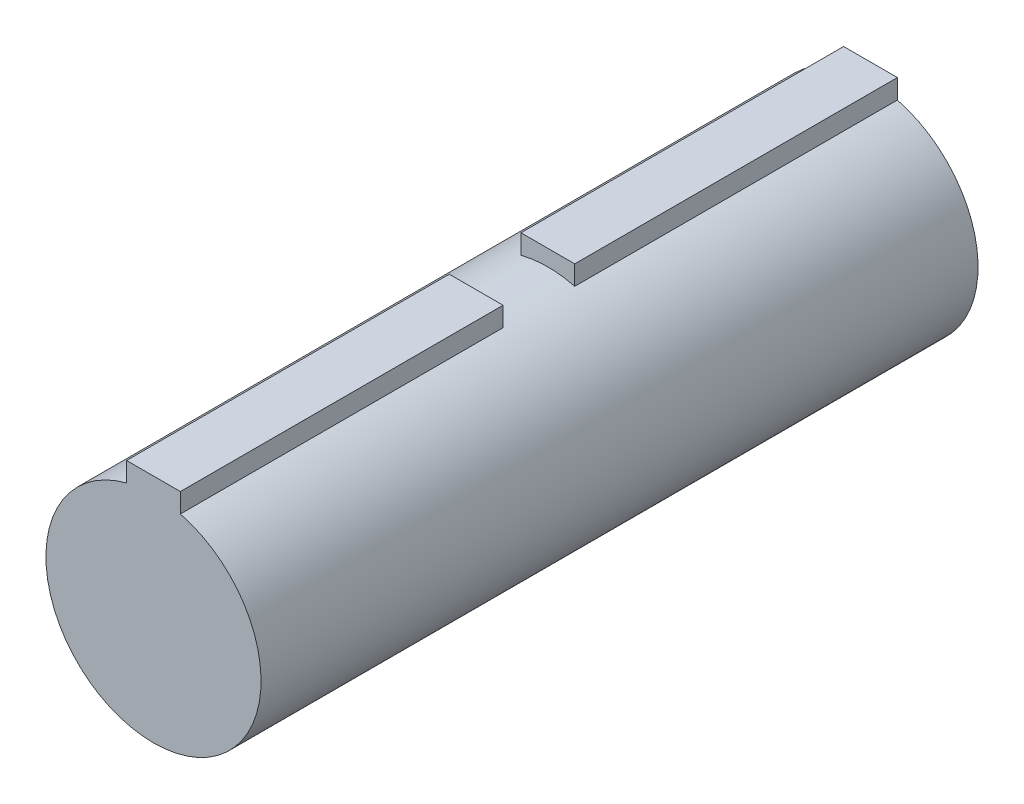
ISO-10303-21;
HEADER;
FILE_DESCRIPTION(('STEP AP214'),'2;1');
FILE_NAME('part.step','',(''),(''),'','','');
FILE_SCHEMA(('AUTOMOTIVE_DESIGN { 1 0 10303 214 1 1 1 1 }'));
ENDSEC;
DATA;
#1=APPLICATION_CONTEXT('core data for automotive mechanical design processes');
#2=APPLICATION_PROTOCOL_DEFINITION('international standard','automotive_design',2000,#1);
#3=PRODUCT_CONTEXT('',#1,'mechanical');
#4=PRODUCT('Part','Part','',(#3));
#5=PRODUCT_RELATED_PRODUCT_CATEGORY('part','',(#4));
#6=PRODUCT_DEFINITION_FORMATION('','',#4);
#7=PRODUCT_DEFINITION_CONTEXT('part definition',#1,'design');
#8=PRODUCT_DEFINITION('design','',#6,#7);
#9=PRODUCT_DEFINITION_SHAPE('','',#8);
#10=(LENGTH_UNIT() NAMED_UNIT(*) SI_UNIT(.MILLI.,.METRE.));
#11=(NAMED_UNIT(*) PLANE_ANGLE_UNIT() SI_UNIT($,.RADIAN.));
#12=(NAMED_UNIT(*) SI_UNIT($,.STERADIAN.) SOLID_ANGLE_UNIT());
#13=UNCERTAINTY_MEASURE_WITH_UNIT(LENGTH_MEASURE(1.E-05),#10,'distance_accuracy_value','');
#14=(GEOMETRIC_REPRESENTATION_CONTEXT(3) GLOBAL_UNCERTAINTY_ASSIGNED_CONTEXT((#13)) GLOBAL_UNIT_ASSIGNED_CONTEXT((#10,
#11,#12)) REPRESENTATION_CONTEXT('',''));
#15=CARTESIAN_POINT('',(0.,0.,0.));
#16=DIRECTION('',(0.,0.,1.));
#17=DIRECTION('',(1.,0.,0.));
#18=AXIS2_PLACEMENT_3D('',#15,#16,#17);
#19=CARTESIAN_POINT('',(-2.38125,10.9473999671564,28.575));
#20=DIRECTION('',(1.,0.,0.));
#21=DIRECTION('',(0.,1.,0.));
#22=AXIS2_PLACEMENT_3D('',#19,#20,#21);
#23=PLANE('',#22);
#24=DIRECTION('',(0.,-1.,0.));
#25=VECTOR('',#24,1.);
#26=CARTESIAN_POINT('',(-2.38125,10.9473999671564,0.));
#27=LINE('',#26,#25);
#28=CARTESIAN_POINT('',(-2.38125,10.9473999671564,0.));
#29=VERTEX_POINT('',#28);
#30=CARTESIAN_POINT('',(-2.38125,9.22254159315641,0.));
#31=VERTEX_POINT('',#30);
#32=EDGE_CURVE('E153',#29,#31,#27,.T.);
#33=ORIENTED_EDGE('',*,*,#32,.T.);
#34=DIRECTION('',(0.,0.,-1.));
#35=VECTOR('',#34,1.);
#36=CARTESIAN_POINT('',(-2.38125,9.22254159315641,28.575));
#37=LINE('',#36,#35);
#38=CARTESIAN_POINT('',(-2.38125,9.22254159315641,28.575));
#39=VERTEX_POINT('',#38);
#40=EDGE_CURVE('E11',#39,#31,#37,.T.);
#41=ORIENTED_EDGE('',*,*,#40,.F.);
#42=DIRECTION('',(0.,-1.,0.));
#43=VECTOR('',#42,1.);
#44=CARTESIAN_POINT('',(-2.38125,10.9473999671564,28.575));
#45=LINE('',#44,#43);
#46=CARTESIAN_POINT('',(-2.38125,10.9473999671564,28.575));
#47=VERTEX_POINT('',#46);
#48=EDGE_CURVE('E89',#47,#39,#45,.T.);
#49=ORIENTED_EDGE('',*,*,#48,.F.);
#50=DIRECTION('',(0.,0.,-1.));
#51=VECTOR('',#50,1.);
#52=CARTESIAN_POINT('',(-2.38125,10.9473999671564,28.575));
#53=LINE('',#52,#51);
#54=EDGE_CURVE('E65',#47,#29,#53,.T.);
#55=ORIENTED_EDGE('',*,*,#54,.T.);
#56=EDGE_LOOP('',(#33,#41,#49,#55));
#57=FACE_BOUND('',#56,.T.);
#58=ADVANCED_FACE('F41',(#57),#23,.F.);
#59=CARTESIAN_POINT('',(0.,0.,28.575));
#60=DIRECTION('',(0.,0.,-1.));
#61=DIRECTION('',(-1.,0.,0.));
#62=AXIS2_PLACEMENT_3D('',#59,#60,#61);
#63=CYLINDRICAL_SURFACE('',#62,9.525);
#64=CARTESIAN_POINT('',(0.,0.,0.));
#65=DIRECTION('',(0.,0.,1.));
#66=DIRECTION('',(1.,0.,0.));
#67=AXIS2_PLACEMENT_3D('',#64,#65,#66);
#68=CIRCLE('',#67,9.525);
#69=CARTESIAN_POINT('',(2.38125,9.22254159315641,0.));
#70=VERTEX_POINT('',#69);
#71=EDGE_CURVE('E166',#31,#70,#68,.T.);
#72=ORIENTED_EDGE('',*,*,#71,.T.);
#73=DIRECTION('',(0.,0.,-1.));
#74=VECTOR('',#73,1.);
#75=CARTESIAN_POINT('',(2.38125,9.22254159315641,28.575));
#76=LINE('',#75,#74);
#77=CARTESIAN_POINT('',(2.38125,9.22254159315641,28.575));
#78=VERTEX_POINT('',#77);
#79=EDGE_CURVE('E49',#78,#70,#76,.T.);
#80=ORIENTED_EDGE('',*,*,#79,.F.);
#81=CARTESIAN_POINT('',(0.,0.,28.575));
#82=DIRECTION('',(0.,0.,1.));
#83=DIRECTION('',(1.,0.,0.));
#84=AXIS2_PLACEMENT_3D('',#81,#82,#83);
#85=CIRCLE('',#84,9.525);
#86=EDGE_CURVE('E142',#78,#39,#85,.T.);
#87=ORIENTED_EDGE('',*,*,#86,.T.);
#88=ORIENTED_EDGE('',*,*,#40,.T.);
#89=EDGE_LOOP('',(#72,#80,#87,#88));
#90=FACE_BOUND('',#89,.T.);
#91=CARTESIAN_POINT('',(0.,0.,34.925));
#92=DIRECTION('',(0.,0.,1.));
#93=DIRECTION('',(1.,0.,0.));
#94=AXIS2_PLACEMENT_3D('',#91,#92,#93);
#95=CIRCLE('',#94,9.525);
#96=CARTESIAN_POINT('',(2.38125,9.22254159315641,34.925));
#97=VERTEX_POINT('',#96);
#98=CARTESIAN_POINT('',(-2.38125,9.22254159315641,34.925));
#99=VERTEX_POINT('',#98);
#100=EDGE_CURVE('E56',#97,#99,#95,.T.);
#101=ORIENTED_EDGE('',*,*,#100,.F.);
#102=DIRECTION('',(0.,0.,-1.));
#103=VECTOR('',#102,1.);
#104=CARTESIAN_POINT('',(2.38125,9.22254159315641,63.5));
#105=LINE('',#104,#103);
#106=CARTESIAN_POINT('',(2.38125,9.22254159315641,63.5));
#107=VERTEX_POINT('',#106);
#108=EDGE_CURVE('E122',#107,#97,#105,.T.);
#109=ORIENTED_EDGE('',*,*,#108,.F.);
#110=CARTESIAN_POINT('',(0.,0.,63.5));
#111=DIRECTION('',(0.,0.,1.));
#112=DIRECTION('',(1.,0.,0.));
#113=AXIS2_PLACEMENT_3D('',#110,#111,#112);
#114=CIRCLE('',#113,9.525);
#115=CARTESIAN_POINT('',(-2.38125,9.22254159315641,63.5));
#116=VERTEX_POINT('',#115);
#117=EDGE_CURVE('E115',#116,#107,#114,.T.);
#118=ORIENTED_EDGE('',*,*,#117,.F.);
#119=DIRECTION('',(0.,0.,-1.));
#120=VECTOR('',#119,1.);
#121=CARTESIAN_POINT('',(-2.38125,9.22254159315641,63.5));
#122=LINE('',#121,#120);
#123=EDGE_CURVE('E119',#116,#99,#122,.T.);
#124=ORIENTED_EDGE('',*,*,#123,.T.);
#125=EDGE_LOOP('',(#101,#109,#118,#124));
#126=FACE_BOUND('',#125,.T.);
#127=ADVANCED_FACE('F117',(#90,#126),#63,.T.);
#128=CARTESIAN_POINT('',(2.38125,10.9473999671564,28.575));
#129=DIRECTION('',(1.,0.,0.));
#130=DIRECTION('',(0.,1.,0.));
#131=AXIS2_PLACEMENT_3D('',#128,#129,#130);
#132=PLANE('',#131);
#133=DIRECTION('',(0.,-1.,0.));
#134=VECTOR('',#133,1.);
#135=CARTESIAN_POINT('',(2.38125,10.9473999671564,0.));
#136=LINE('',#135,#134);
#137=CARTESIAN_POINT('',(2.38125,10.9473999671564,0.));
#138=VERTEX_POINT('',#137);
#139=EDGE_CURVE('E170',#138,#70,#136,.T.);
#140=ORIENTED_EDGE('',*,*,#139,.F.);
#141=DIRECTION('',(0.,0.,-1.));
#142=VECTOR('',#141,1.);
#143=CARTESIAN_POINT('',(2.38125,10.9473999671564,28.575));
#144=LINE('',#143,#142);
#145=CARTESIAN_POINT('',(2.38125,10.9473999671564,28.575));
#146=VERTEX_POINT('',#145);
#147=EDGE_CURVE('E179',#146,#138,#144,.T.);
#148=ORIENTED_EDGE('',*,*,#147,.F.);
#149=DIRECTION('',(0.,-1.,0.));
#150=VECTOR('',#149,1.);
#151=CARTESIAN_POINT('',(2.38125,10.9473999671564,28.575));
#152=LINE('',#151,#150);
#153=EDGE_CURVE('E157',#146,#78,#152,.T.);
#154=ORIENTED_EDGE('',*,*,#153,.T.);
#155=ORIENTED_EDGE('',*,*,#79,.T.);
#156=EDGE_LOOP('',(#140,#148,#154,#155));
#157=FACE_BOUND('',#156,.T.);
#158=ADVANCED_FACE('F185',(#157),#132,.T.);
#159=CARTESIAN_POINT('',(-2.38125,10.9473999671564,28.575));
#160=DIRECTION('',(0.,1.,0.));
#161=DIRECTION('',(0.,0.,1.));
#162=AXIS2_PLACEMENT_3D('',#159,#160,#161);
#163=PLANE('',#162);
#164=DIRECTION('',(1.,0.,0.));
#165=VECTOR('',#164,1.);
#166=CARTESIAN_POINT('',(-2.38125,10.9473999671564,0.));
#167=LINE('',#166,#165);
#168=EDGE_CURVE('E158',#29,#138,#167,.T.);
#169=ORIENTED_EDGE('',*,*,#168,.F.);
#170=ORIENTED_EDGE('',*,*,#54,.F.);
#171=DIRECTION('',(1.,0.,0.));
#172=VECTOR('',#171,1.);
#173=CARTESIAN_POINT('',(-2.38125,10.9473999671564,28.575));
#174=LINE('',#173,#172);
#175=EDGE_CURVE('E161',#47,#146,#174,.T.);
#176=ORIENTED_EDGE('',*,*,#175,.T.);
#177=ORIENTED_EDGE('',*,*,#147,.T.);
#178=EDGE_LOOP('',(#169,#170,#176,#177));
#179=FACE_BOUND('',#178,.T.);
#180=ADVANCED_FACE('F190',(#179),#163,.T.);
#181=CARTESIAN_POINT('',(0.,0.,28.575));
#182=DIRECTION('',(0.,0.,1.));
#183=DIRECTION('',(1.,0.,0.));
#184=AXIS2_PLACEMENT_3D('',#181,#182,#183);
#185=PLANE('',#184);
#186=ORIENTED_EDGE('',*,*,#86,.F.);
#187=ORIENTED_EDGE('',*,*,#153,.F.);
#188=ORIENTED_EDGE('',*,*,#175,.F.);
#189=ORIENTED_EDGE('',*,*,#48,.T.);
#190=EDGE_LOOP('',(#186,#187,#188,#189));
#191=FACE_BOUND('',#190,.T.);
#192=ADVANCED_FACE('F191',(#191),#185,.T.);
#193=CARTESIAN_POINT('',(0.,0.,0.));
#194=DIRECTION('',(0.,0.,1.));
#195=DIRECTION('',(1.,0.,0.));
#196=AXIS2_PLACEMENT_3D('',#193,#194,#195);
#197=PLANE('',#196);
#198=ORIENTED_EDGE('',*,*,#32,.F.);
#199=ORIENTED_EDGE('',*,*,#168,.T.);
#200=ORIENTED_EDGE('',*,*,#139,.T.);
#201=ORIENTED_EDGE('',*,*,#71,.F.);
#202=EDGE_LOOP('',(#198,#199,#200,#201));
#203=FACE_BOUND('',#202,.T.);
#204=ADVANCED_FACE('F189',(#203),#197,.F.);
#205=CARTESIAN_POINT('',(0.,0.,34.925));
#206=DIRECTION('',(0.,0.,1.));
#207=DIRECTION('',(1.,0.,0.));
#208=AXIS2_PLACEMENT_3D('',#205,#206,#207);
#209=PLANE('',#208);
#210=DIRECTION('',(0.,-1.,0.));
#211=VECTOR('',#210,1.);
#212=CARTESIAN_POINT('',(2.38125,10.9473999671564,34.925));
#213=LINE('',#212,#211);
#214=CARTESIAN_POINT('',(2.38125,10.9473999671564,34.925));
#215=VERTEX_POINT('',#214);
#216=EDGE_CURVE('E288',#215,#97,#213,.T.);
#217=ORIENTED_EDGE('',*,*,#216,.T.);
#218=ORIENTED_EDGE('',*,*,#100,.T.);
#219=DIRECTION('',(0.,-1.,0.));
#220=VECTOR('',#219,1.);
#221=CARTESIAN_POINT('',(-2.38125,10.9473999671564,34.925));
#222=LINE('',#221,#220);
#223=CARTESIAN_POINT('',(-2.38125,10.9473999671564,34.925));
#224=VERTEX_POINT('',#223);
#225=EDGE_CURVE('E140',#224,#99,#222,.T.);
#226=ORIENTED_EDGE('',*,*,#225,.F.);
#227=DIRECTION('',(1.,0.,0.));
#228=VECTOR('',#227,1.);
#229=CARTESIAN_POINT('',(-2.38125,10.9473999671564,34.925));
#230=LINE('',#229,#228);
#231=EDGE_CURVE('E137',#224,#215,#230,.T.);
#232=ORIENTED_EDGE('',*,*,#231,.T.);
#233=EDGE_LOOP('',(#217,#218,#226,#232));
#234=FACE_BOUND('',#233,.T.);
#235=ADVANCED_FACE('F198',(#234),#209,.F.);
#236=CARTESIAN_POINT('',(-2.38125,10.9473999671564,63.5));
#237=DIRECTION('',(1.,0.,0.));
#238=DIRECTION('',(0.,0.,-1.));
#239=AXIS2_PLACEMENT_3D('',#236,#237,#238);
#240=PLANE('',#239);
#241=ORIENTED_EDGE('',*,*,#225,.T.);
#242=ORIENTED_EDGE('',*,*,#123,.F.);
#243=DIRECTION('',(0.,-1.,0.));
#244=VECTOR('',#243,1.);
#245=CARTESIAN_POINT('',(-2.38125,10.9473999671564,63.5));
#246=LINE('',#245,#244);
#247=CARTESIAN_POINT('',(-2.38125,10.9473999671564,63.5));
#248=VERTEX_POINT('',#247);
#249=EDGE_CURVE('E128',#248,#116,#246,.T.);
#250=ORIENTED_EDGE('',*,*,#249,.F.);
#251=DIRECTION('',(0.,0.,-1.));
#252=VECTOR('',#251,1.);
#253=CARTESIAN_POINT('',(-2.38125,10.9473999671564,63.5));
#254=LINE('',#253,#252);
#255=EDGE_CURVE('E285',#248,#224,#254,.T.);
#256=ORIENTED_EDGE('',*,*,#255,.T.);
#257=EDGE_LOOP('',(#241,#242,#250,#256));
#258=FACE_BOUND('',#257,.T.);
#259=ADVANCED_FACE('F139',(#258),#240,.F.);
#260=CARTESIAN_POINT('',(2.38125,10.9473999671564,63.5));
#261=DIRECTION('',(1.,0.,0.));
#262=DIRECTION('',(0.,0.,-1.));
#263=AXIS2_PLACEMENT_3D('',#260,#261,#262);
#264=PLANE('',#263);
#265=ORIENTED_EDGE('',*,*,#216,.F.);
#266=DIRECTION('',(0.,0.,-1.));
#267=VECTOR('',#266,1.);
#268=CARTESIAN_POINT('',(2.38125,10.9473999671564,63.5));
#269=LINE('',#268,#267);
#270=CARTESIAN_POINT('',(2.38125,10.9473999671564,63.5));
#271=VERTEX_POINT('',#270);
#272=EDGE_CURVE('E148',#271,#215,#269,.T.);
#273=ORIENTED_EDGE('',*,*,#272,.F.);
#274=DIRECTION('',(0.,-1.,0.));
#275=VECTOR('',#274,1.);
#276=CARTESIAN_POINT('',(2.38125,10.9473999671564,63.5));
#277=LINE('',#276,#275);
#278=EDGE_CURVE('E127',#271,#107,#277,.T.);
#279=ORIENTED_EDGE('',*,*,#278,.T.);
#280=ORIENTED_EDGE('',*,*,#108,.T.);
#281=EDGE_LOOP('',(#265,#273,#279,#280));
#282=FACE_BOUND('',#281,.T.);
#283=ADVANCED_FACE('F253',(#282),#264,.T.);
#284=CARTESIAN_POINT('',(-2.38125,10.9473999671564,63.5));
#285=DIRECTION('',(0.,1.,0.));
#286=DIRECTION('',(0.,0.,1.));
#287=AXIS2_PLACEMENT_3D('',#284,#285,#286);
#288=PLANE('',#287);
#289=ORIENTED_EDGE('',*,*,#231,.F.);
#290=ORIENTED_EDGE('',*,*,#255,.F.);
#291=DIRECTION('',(1.,0.,0.));
#292=VECTOR('',#291,1.);
#293=CARTESIAN_POINT('',(-2.38125,10.9473999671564,63.5));
#294=LINE('',#293,#292);
#295=EDGE_CURVE('E134',#248,#271,#294,.T.);
#296=ORIENTED_EDGE('',*,*,#295,.T.);
#297=ORIENTED_EDGE('',*,*,#272,.T.);
#298=EDGE_LOOP('',(#289,#290,#296,#297));
#299=FACE_BOUND('',#298,.T.);
#300=ADVANCED_FACE('F261',(#299),#288,.T.);
#301=CARTESIAN_POINT('',(0.,0.,63.5));
#302=DIRECTION('',(0.,0.,1.));
#303=DIRECTION('',(1.,0.,0.));
#304=AXIS2_PLACEMENT_3D('',#301,#302,#303);
#305=PLANE('',#304);
#306=ORIENTED_EDGE('',*,*,#249,.T.);
#307=ORIENTED_EDGE('',*,*,#117,.T.);
#308=ORIENTED_EDGE('',*,*,#278,.F.);
#309=ORIENTED_EDGE('',*,*,#295,.F.);
#310=EDGE_LOOP('',(#306,#307,#308,#309));
#311=FACE_BOUND('',#310,.T.);
#312=ADVANCED_FACE('F132',(#311),#305,.T.);
#313=CLOSED_SHELL('',(#58,#127,#158,#180,#192,#204,#235,#259,#283,#300,#312));
#314=MANIFOLD_SOLID_BREP('B2',#313);
#315=ADVANCED_BREP_SHAPE_REPRESENTATION('',(#18,#314),#14);
#316=SHAPE_DEFINITION_REPRESENTATION(#9,#315);
ENDSEC;
END-ISO-10303-21;
